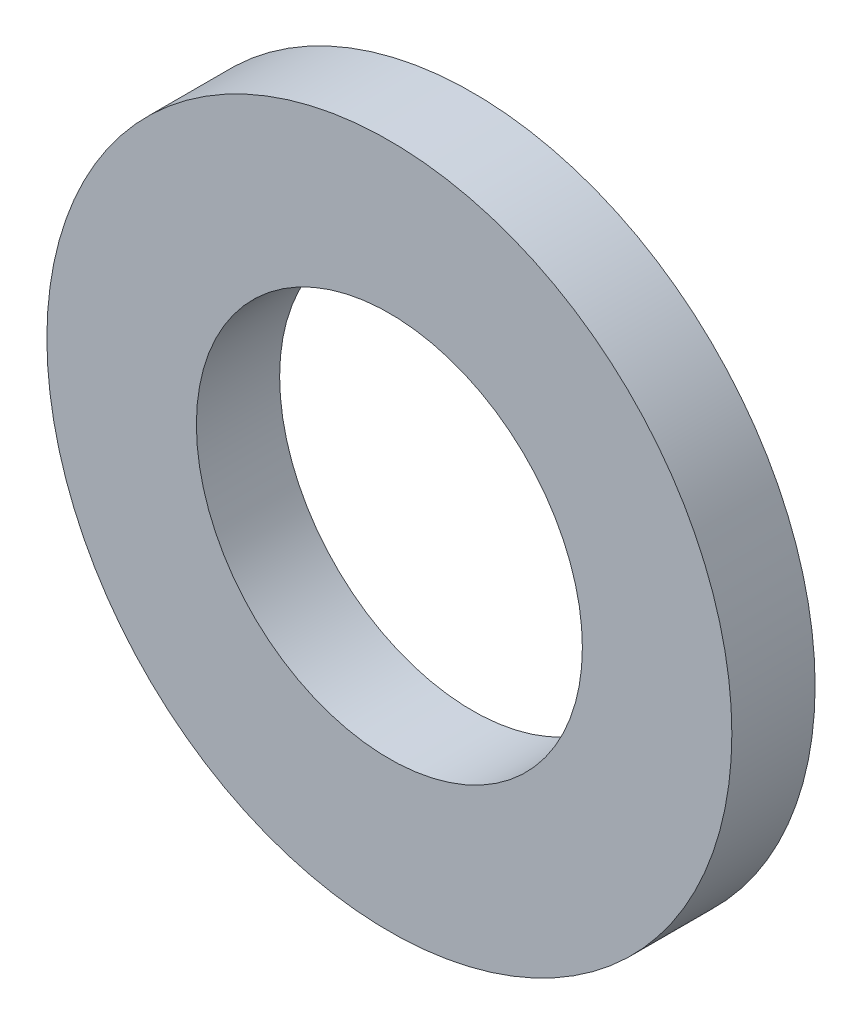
from build123d import *

# Parameters (mm, degrees)
SKETCH1_R           = 9.05
SKETCH1_R_2         = 5.1
BOSS_EXTRUDE1_DEPTH = 2.2


with BuildPart() as part:
    # Sketch1 → Boss-Extrude1 (new body)
    with BuildSketch(Plane.XY):
        Circle(SKETCH1_R)
        Circle(SKETCH1_R_2, mode=Mode.SUBTRACT)
    extrude(amount=BOSS_EXTRUDE1_DEPTH)


solid = part.part
